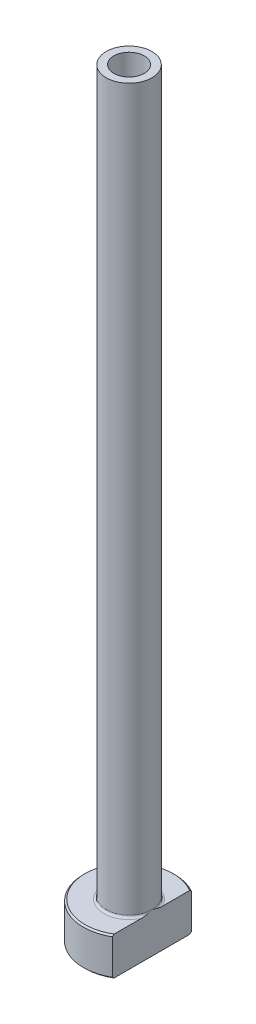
from build123d import *

# Parameters (mm, degrees)
FILLET1_R          = 0.3
CHAMFER1_SIZE      = 0.2
CUT_EXTRUDE1_DEPTH = 101.359354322
CHAMFER2_SIZE      = 0.5


with BuildPart() as part:
    # Sketch1 → Revolve1 (revolve)
    with BuildSketch(Plane.XY, mode=Mode.PRIVATE) as revolve1_sk:
        Polygon((-2, 100), (-3, 100), (-3, 5), (-6, 5), (-6, 0), (-2.25, 0), (-2.25, 43), (-2, 55), align=None)
    revolve(revolve1_sk.sketch.rotate(Axis((0, 92.187680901, 0), (0, -1, 0)), 270), axis=Axis((0, 92.187680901, 0), (0, -1, 0)))

    # Fillet1
    fillet1_edges = [part.edges().sort_by_distance(p)[0] for p in [
        (0, 5, -3),
    ]]
    fillet(fillet1_edges, radius=FILLET1_R)

    # Chamfer1
    chamfer1_edges = [part.edges().sort_by_distance(p)[0] for p in [
        (0, 0, -6),
        (0, 5, -6),
    ]]
    chamfer(chamfer1_edges, length=CHAMFER1_SIZE)

    # Sketch2 → Cut-Extrude1 (cut, through all)
    with BuildSketch(Plane.XZ):
        with BuildLine():
            Line((3, 5.196152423), (3, -5.196152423))
            ThreePointArc((3, -5.196152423), (6, 0), (3, 5.196152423))
        make_face()
    extrude(amount=-CUT_EXTRUDE1_DEPTH, mode=Mode.SUBTRACT)

    # Chamfer2
    chamfer2_edges = [part.edges().sort_by_distance(p)[0] for p in [
        (0, 0, -2.25),
    ]]
    chamfer(chamfer2_edges, length=CHAMFER2_SIZE)


solid = part.part
